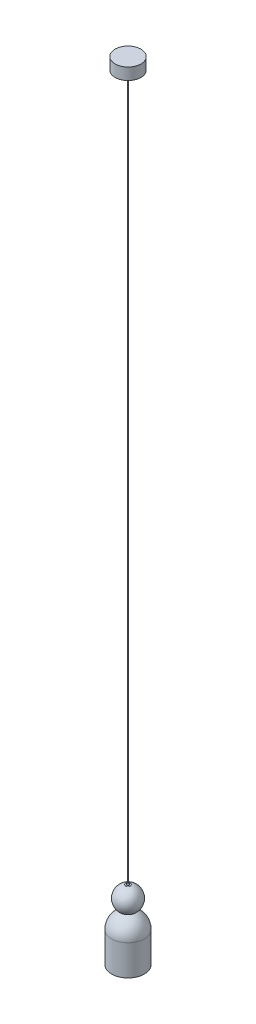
from build123d import *

# Parameters (mm, degrees)
VACIADO1_T              = -3
CROQUIS3_R              = 5
SALIENTE_EXTRUIR1_DEPTH = 10
CROQUIS4_R              = 10
SALIENTE_EXTRUIR2_DEPTH = 1
CROQUIS5_R              = 1.5
SALIENTE_EXTRUIR3_DEPTH = 3000
CROQUIS6_R              = 54.991
SALIENTE_EXTRUIR4_DEPTH = 50.038


with BuildPart() as part:
    # Croquis1 → Revoluci_n1 (revolve)
    with BuildSketch(Plane.XY, mode=Mode.PRIVATE) as revoluci_n1_sk:
        with BuildLine():
            Line((0, 0), (0, 200))
            ThreePointArc((0, 200), (-49.497474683, 179.497474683), (-70, 130))
            Line((-70, 130), (-70, 0))
            Line((-70, 0), (0, 0))
        make_face()
    revolve(revoluci_n1_sk.sketch.rotate(Axis((0, 0, 0), (0, 1, 0)), 180), axis=Axis((0, 0, 0), (0, 1, 0)))

    # Vaciado1
    vaciado1_openings = [part.faces().sort_by_distance(p)[0] for p in [
        (0, 0, 0),
    ]]
    offset(amount=VACIADO1_T, openings=vaciado1_openings, kind=Kind.INTERSECTION)


with BuildPart() as body_2:
    # Croquis2 → Revoluci_n2 (revolve)
    with BuildSketch(Plane(origin=(0, 0, 0), x_dir=(0, 0, -1), z_dir=(1, 0, 0))):
        with BuildLine():
            Line((0, 195.255744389), (0, 295.255744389))
            ThreePointArc((0, 295.255744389), (-50, 245.255744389), (0, 195.255744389))
        make_face()
    revolve(axis=Axis((0, 195.255744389, 0), (0, 1, 0)))


with BuildPart() as body_3:
    # Croquis3 → Saliente-Extruir1 (new body)
    with BuildSketch(Plane(origin=(0, 295, 0), x_dir=(1, 0, 0), z_dir=(0, 1, 0))):
        with Locations(Location((0, 0, 0), (0, 0, 270))):
            Circle(CROQUIS3_R)
    extrude(amount=SALIENTE_EXTRUIR1_DEPTH)


with BuildPart() as body_4:
    # Croquis4 → Saliente-Extruir2 (new body)
    with BuildSketch(Plane(origin=(0, 295, 0), x_dir=(1, 0, 0), z_dir=(0, 1, 0))):
        with Locations(Location((0, 0, 0), (0, 0, 270))):
            Circle(CROQUIS4_R)
    extrude(amount=SALIENTE_EXTRUIR2_DEPTH)


with BuildPart() as body_5:
    # Croquis5 → Saliente-Extruir3 (new body)
    with BuildSketch(Plane(origin=(0, 305, 0), x_dir=(1, 0, 0), z_dir=(0, 1, 0))):
        with Locations(Location((0, 0, 0), (0, 0, 270))):
            Circle(CROQUIS5_R)
    extrude(amount=SALIENTE_EXTRUIR3_DEPTH)

    # Croquis6 → Saliente-Extruir4 (add)
    with BuildSketch(Plane(origin=(0, 3305, 0), x_dir=(1, 0, 0), z_dir=(0, 1, 0))):
        with Locations(Location((0, 0, 0), (0, 0, 270))):
            Circle(CROQUIS6_R)
    extrude(amount=SALIENTE_EXTRUIR4_DEPTH)


solid = Compound([part.part, body_2.part, body_3.part, body_4.part, body_5.part])
